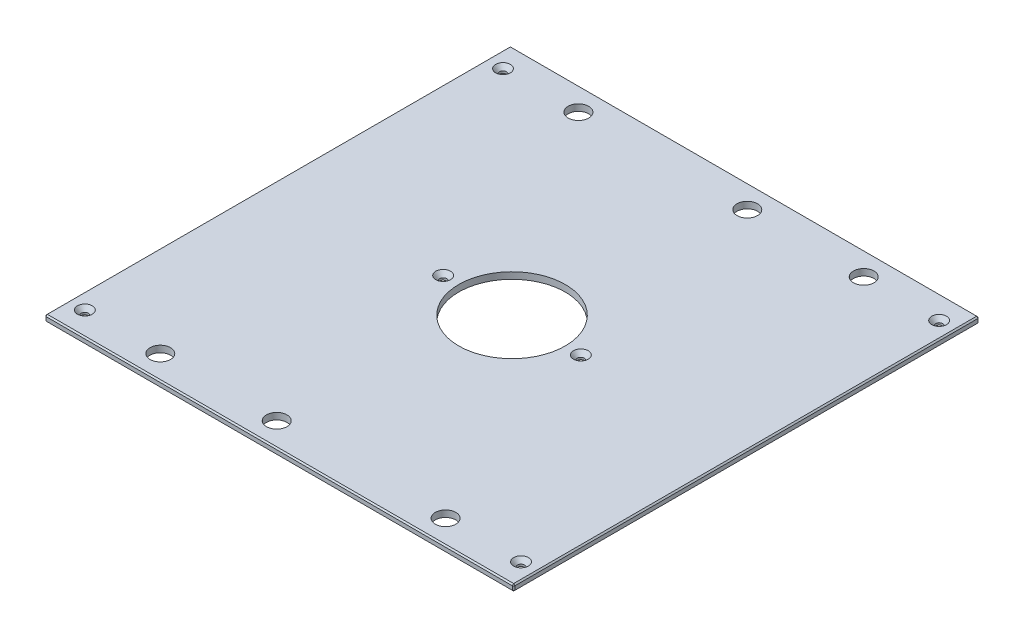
ISO-10303-21;
HEADER;
FILE_DESCRIPTION(('STEP AP214'),'2;1');
FILE_NAME('part.step','',(''),(''),'','','');
FILE_SCHEMA(('AUTOMOTIVE_DESIGN { 1 0 10303 214 1 1 1 1 }'));
ENDSEC;
DATA;
#1=APPLICATION_CONTEXT('core data for automotive mechanical design processes');
#2=APPLICATION_PROTOCOL_DEFINITION('international standard','automotive_design',2000,#1);
#3=PRODUCT_CONTEXT('',#1,'mechanical');
#4=PRODUCT('Part','Part','',(#3));
#5=PRODUCT_RELATED_PRODUCT_CATEGORY('part','',(#4));
#6=PRODUCT_DEFINITION_FORMATION('','',#4);
#7=PRODUCT_DEFINITION_CONTEXT('part definition',#1,'design');
#8=PRODUCT_DEFINITION('design','',#6,#7);
#9=PRODUCT_DEFINITION_SHAPE('','',#8);
#10=(LENGTH_UNIT() NAMED_UNIT(*) SI_UNIT(.MILLI.,.METRE.));
#11=(NAMED_UNIT(*) PLANE_ANGLE_UNIT() SI_UNIT($,.RADIAN.));
#12=(NAMED_UNIT(*) SI_UNIT($,.STERADIAN.) SOLID_ANGLE_UNIT());
#13=UNCERTAINTY_MEASURE_WITH_UNIT(LENGTH_MEASURE(1.E-05),#10,'distance_accuracy_value','');
#14=(GEOMETRIC_REPRESENTATION_CONTEXT(3) GLOBAL_UNCERTAINTY_ASSIGNED_CONTEXT((#13)) GLOBAL_UNIT_ASSIGNED_CONTEXT((#10,
#11,#12)) REPRESENTATION_CONTEXT('',''));
#15=CARTESIAN_POINT('',(0.,0.,0.));
#16=DIRECTION('',(0.,0.,1.));
#17=DIRECTION('',(1.,0.,0.));
#18=AXIS2_PLACEMENT_3D('',#15,#16,#17);
#19=CARTESIAN_POINT('',(-227.0125,6.35,-225.425));
#20=DIRECTION('',(1.,0.,0.));
#21=DIRECTION('',(0.,0.,-1.));
#22=AXIS2_PLACEMENT_3D('',#19,#20,#21);
#23=PLANE('',#22);
#24=DIRECTION('',(0.,0.,-1.));
#25=VECTOR('',#24,1.);
#26=CARTESIAN_POINT('',(-227.0125,5.08000000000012,-225.425));
#27=LINE('',#26,#25);
#28=CARTESIAN_POINT('',(-227.0125,5.08000000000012,224.155));
#29=VERTEX_POINT('',#28);
#30=CARTESIAN_POINT('',(-227.0125,5.08000000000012,-224.155));
#31=VERTEX_POINT('',#30);
#32=EDGE_CURVE('E135',#29,#31,#27,.T.);
#33=ORIENTED_EDGE('',*,*,#32,.T.);
#34=DIRECTION('',(0.,-1.,0.));
#35=VECTOR('',#34,1.);
#36=CARTESIAN_POINT('',(-227.0125,6.35,-224.155));
#37=LINE('',#36,#35);
#38=CARTESIAN_POINT('',(-227.0125,1.26999999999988,-224.155));
#39=VERTEX_POINT('',#38);
#40=EDGE_CURVE('E131',#31,#39,#37,.T.);
#41=ORIENTED_EDGE('',*,*,#40,.T.);
#42=DIRECTION('',(0.,0.,1.));
#43=VECTOR('',#42,1.);
#44=CARTESIAN_POINT('',(-227.0125,1.26999999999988,-225.425));
#45=LINE('',#44,#43);
#46=CARTESIAN_POINT('',(-227.0125,1.26999999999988,224.155));
#47=VERTEX_POINT('',#46);
#48=EDGE_CURVE('E126',#39,#47,#45,.T.);
#49=ORIENTED_EDGE('',*,*,#48,.T.);
#50=DIRECTION('',(0.,1.,0.));
#51=VECTOR('',#50,1.);
#52=CARTESIAN_POINT('',(-227.0125,6.35,224.155));
#53=LINE('',#52,#51);
#54=EDGE_CURVE('E128',#47,#29,#53,.T.);
#55=ORIENTED_EDGE('',*,*,#54,.T.);
#56=EDGE_LOOP('',(#33,#41,#49,#55));
#57=FACE_BOUND('',#56,.T.);
#58=ADVANCED_FACE('F35',(#57),#23,.F.);
#59=CARTESIAN_POINT('',(-227.0125,6.35,225.425));
#60=DIRECTION('',(0.,0.,-1.));
#61=DIRECTION('',(-1.,0.,0.));
#62=AXIS2_PLACEMENT_3D('',#59,#60,#61);
#63=PLANE('',#62);
#64=DIRECTION('',(1.,0.,0.));
#65=VECTOR('',#64,1.);
#66=CARTESIAN_POINT('',(-227.0125,1.26999999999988,225.425));
#67=LINE('',#66,#65);
#68=CARTESIAN_POINT('',(-225.7425,1.26999999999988,225.425));
#69=VERTEX_POINT('',#68);
#70=CARTESIAN_POINT('',(225.7425,1.26999999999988,225.425));
#71=VERTEX_POINT('',#70);
#72=EDGE_CURVE('E58',#69,#71,#67,.T.);
#73=ORIENTED_EDGE('',*,*,#72,.T.);
#74=DIRECTION('',(0.,1.,0.));
#75=VECTOR('',#74,1.);
#76=CARTESIAN_POINT('',(225.7425,6.35,225.425));
#77=LINE('',#76,#75);
#78=CARTESIAN_POINT('',(225.7425,5.08000000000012,225.425));
#79=VERTEX_POINT('',#78);
#80=EDGE_CURVE('E11',#71,#79,#77,.T.);
#81=ORIENTED_EDGE('',*,*,#80,.T.);
#82=DIRECTION('',(-1.,0.,0.));
#83=VECTOR('',#82,1.);
#84=CARTESIAN_POINT('',(-227.0125,5.08000000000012,225.425));
#85=LINE('',#84,#83);
#86=CARTESIAN_POINT('',(-225.7425,5.08000000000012,225.425));
#87=VERTEX_POINT('',#86);
#88=EDGE_CURVE('E44',#79,#87,#85,.T.);
#89=ORIENTED_EDGE('',*,*,#88,.T.);
#90=DIRECTION('',(0.,-1.,0.));
#91=VECTOR('',#90,1.);
#92=CARTESIAN_POINT('',(-225.7425,6.35,225.425));
#93=LINE('',#92,#91);
#94=EDGE_CURVE('E291',#87,#69,#93,.T.);
#95=ORIENTED_EDGE('',*,*,#94,.T.);
#96=EDGE_LOOP('',(#73,#81,#89,#95));
#97=FACE_BOUND('',#96,.T.);
#98=ADVANCED_FACE('F360',(#97),#63,.F.);
#99=CARTESIAN_POINT('',(227.0125,6.35,-225.425));
#100=DIRECTION('',(-1.,0.,0.));
#101=DIRECTION('',(0.,0.,1.));
#102=AXIS2_PLACEMENT_3D('',#99,#100,#101);
#103=PLANE('',#102);
#104=DIRECTION('',(0.,0.,-1.));
#105=VECTOR('',#104,1.);
#106=CARTESIAN_POINT('',(227.0125,1.26999999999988,-225.425));
#107=LINE('',#106,#105);
#108=CARTESIAN_POINT('',(227.0125,1.26999999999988,224.155));
#109=VERTEX_POINT('',#108);
#110=CARTESIAN_POINT('',(227.0125,1.26999999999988,-224.155));
#111=VERTEX_POINT('',#110);
#112=EDGE_CURVE('E286',#109,#111,#107,.T.);
#113=ORIENTED_EDGE('',*,*,#112,.T.);
#114=DIRECTION('',(0.,1.,0.));
#115=VECTOR('',#114,1.);
#116=CARTESIAN_POINT('',(227.0125,6.35,-224.155));
#117=LINE('',#116,#115);
#118=CARTESIAN_POINT('',(227.0125,5.08000000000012,-224.155));
#119=VERTEX_POINT('',#118);
#120=EDGE_CURVE('E288',#111,#119,#117,.T.);
#121=ORIENTED_EDGE('',*,*,#120,.T.);
#122=DIRECTION('',(0.,0.,1.));
#123=VECTOR('',#122,1.);
#124=CARTESIAN_POINT('',(227.0125,5.08000000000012,225.425));
#125=LINE('',#124,#123);
#126=CARTESIAN_POINT('',(227.0125,5.08000000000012,224.155));
#127=VERTEX_POINT('',#126);
#128=EDGE_CURVE('E284',#119,#127,#125,.T.);
#129=ORIENTED_EDGE('',*,*,#128,.T.);
#130=DIRECTION('',(0.,-1.,0.));
#131=VECTOR('',#130,1.);
#132=CARTESIAN_POINT('',(227.0125,6.35,224.155));
#133=LINE('',#132,#131);
#134=EDGE_CURVE('E282',#127,#109,#133,.T.);
#135=ORIENTED_EDGE('',*,*,#134,.T.);
#136=EDGE_LOOP('',(#113,#121,#129,#135));
#137=FACE_BOUND('',#136,.T.);
#138=ADVANCED_FACE('F347',(#137),#103,.F.);
#139=CARTESIAN_POINT('',(-227.0125,6.35,-225.425));
#140=DIRECTION('',(0.,0.,1.));
#141=DIRECTION('',(1.,0.,0.));
#142=AXIS2_PLACEMENT_3D('',#139,#140,#141);
#143=PLANE('',#142);
#144=DIRECTION('',(-1.,0.,0.));
#145=VECTOR('',#144,1.);
#146=CARTESIAN_POINT('',(-227.0125,1.26999999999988,-225.425));
#147=LINE('',#146,#145);
#148=CARTESIAN_POINT('',(225.7425,1.26999999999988,-225.425));
#149=VERTEX_POINT('',#148);
#150=CARTESIAN_POINT('',(-225.7425,1.26999999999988,-225.425));
#151=VERTEX_POINT('',#150);
#152=EDGE_CURVE('E258',#149,#151,#147,.T.);
#153=ORIENTED_EDGE('',*,*,#152,.T.);
#154=DIRECTION('',(0.,1.,0.));
#155=VECTOR('',#154,1.);
#156=CARTESIAN_POINT('',(-225.7425,6.35,-225.425));
#157=LINE('',#156,#155);
#158=CARTESIAN_POINT('',(-225.7425,5.08000000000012,-225.425));
#159=VERTEX_POINT('',#158);
#160=EDGE_CURVE('E262',#151,#159,#157,.T.);
#161=ORIENTED_EDGE('',*,*,#160,.T.);
#162=DIRECTION('',(1.,0.,0.));
#163=VECTOR('',#162,1.);
#164=CARTESIAN_POINT('',(227.0125,5.08000000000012,-225.425));
#165=LINE('',#164,#163);
#166=CARTESIAN_POINT('',(225.7425,5.08000000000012,-225.425));
#167=VERTEX_POINT('',#166);
#168=EDGE_CURVE('E260',#159,#167,#165,.T.);
#169=ORIENTED_EDGE('',*,*,#168,.T.);
#170=DIRECTION('',(0.,-1.,0.));
#171=VECTOR('',#170,1.);
#172=CARTESIAN_POINT('',(225.7425,6.35,-225.425));
#173=LINE('',#172,#171);
#174=EDGE_CURVE('E256',#167,#149,#173,.T.);
#175=ORIENTED_EDGE('',*,*,#174,.T.);
#176=EDGE_LOOP('',(#153,#161,#169,#175));
#177=FACE_BOUND('',#176,.T.);
#178=ADVANCED_FACE('F321',(#177),#143,.F.);
#179=CARTESIAN_POINT('',(0.,6.35,0.));
#180=DIRECTION('',(0.,1.,0.));
#181=DIRECTION('',(0.,0.,1.));
#182=AXIS2_PLACEMENT_3D('',#179,#180,#181);
#183=PLANE('',#182);
#184=CARTESIAN_POINT('',(211.1375,6.35,-202.40498));
#185=DIRECTION('',(0.,1.,0.));
#186=DIRECTION('',(0.,0.,1.));
#187=AXIS2_PLACEMENT_3D('',#184,#185,#186);
#188=CIRCLE('',#187,7.13739999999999);
#189=CARTESIAN_POINT('',(211.1375,6.35,-195.26758));
#190=VERTEX_POINT('',#189);
#191=EDGE_CURVE('E784',#190,#190,#188,.T.);
#192=ORIENTED_EDGE('',*,*,#191,.F.);
#193=EDGE_LOOP('',(#192));
#194=FACE_BOUND('',#193,.T.);
#195=CARTESIAN_POINT('',(211.1375,6.35,202.40498));
#196=DIRECTION('',(0.,1.,0.));
#197=DIRECTION('',(0.,0.,1.));
#198=AXIS2_PLACEMENT_3D('',#195,#196,#197);
#199=CIRCLE('',#198,7.13739999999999);
#200=CARTESIAN_POINT('',(211.1375,6.35,209.54238));
#201=VERTEX_POINT('',#200);
#202=EDGE_CURVE('E788',#201,#201,#199,.T.);
#203=ORIENTED_EDGE('',*,*,#202,.F.);
#204=EDGE_LOOP('',(#203));
#205=FACE_BOUND('',#204,.T.);
#206=CARTESIAN_POINT('',(-211.1375,6.35,202.40498));
#207=DIRECTION('',(0.,1.,0.));
#208=DIRECTION('',(0.,0.,1.));
#209=AXIS2_PLACEMENT_3D('',#206,#207,#208);
#210=CIRCLE('',#209,7.13739999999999);
#211=CARTESIAN_POINT('',(-211.1375,6.35,209.54238));
#212=VERTEX_POINT('',#211);
#213=EDGE_CURVE('E792',#212,#212,#210,.T.);
#214=ORIENTED_EDGE('',*,*,#213,.F.);
#215=EDGE_LOOP('',(#214));
#216=FACE_BOUND('',#215,.T.);
#217=CARTESIAN_POINT('',(-66.675,6.35,0.));
#218=DIRECTION('',(0.,1.,0.));
#219=DIRECTION('',(0.,0.,1.));
#220=AXIS2_PLACEMENT_3D('',#217,#218,#219);
#221=CIRCLE('',#220,7.1374);
#222=CARTESIAN_POINT('',(-66.675,6.35,7.1374));
#223=VERTEX_POINT('',#222);
#224=EDGE_CURVE('E796',#223,#223,#221,.T.);
#225=ORIENTED_EDGE('',*,*,#224,.F.);
#226=EDGE_LOOP('',(#225));
#227=FACE_BOUND('',#226,.T.);
#228=CARTESIAN_POINT('',(66.675,6.35,0.));
#229=DIRECTION('',(0.,1.,0.));
#230=DIRECTION('',(0.,0.,1.));
#231=AXIS2_PLACEMENT_3D('',#228,#229,#230);
#232=CIRCLE('',#231,7.1374);
#233=CARTESIAN_POINT('',(66.675,6.35,7.1374));
#234=VERTEX_POINT('',#233);
#235=EDGE_CURVE('E800',#234,#234,#232,.T.);
#236=ORIENTED_EDGE('',*,*,#235,.F.);
#237=EDGE_LOOP('',(#236));
#238=FACE_BOUND('',#237,.T.);
#239=CARTESIAN_POINT('',(-211.1375,6.35,-202.40498));
#240=DIRECTION('',(0.,1.,0.));
#241=DIRECTION('',(0.,0.,1.));
#242=AXIS2_PLACEMENT_3D('',#239,#240,#241);
#243=CIRCLE('',#242,7.13739999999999);
#244=CARTESIAN_POINT('',(-211.1375,6.35,-195.26758));
#245=VERTEX_POINT('',#244);
#246=EDGE_CURVE('E803',#245,#245,#243,.T.);
#247=ORIENTED_EDGE('',*,*,#246,.F.);
#248=EDGE_LOOP('',(#247));
#249=FACE_BOUND('',#248,.T.);
#250=DIRECTION('',(0.,0.,-1.));
#251=VECTOR('',#250,1.);
#252=CARTESIAN_POINT('',(225.7425,6.35,-225.425));
#253=LINE('',#252,#251);
#254=CARTESIAN_POINT('',(225.7425,6.35,224.155));
#255=VERTEX_POINT('',#254);
#256=CARTESIAN_POINT('',(225.7425,6.35,-224.155));
#257=VERTEX_POINT('',#256);
#258=EDGE_CURVE('E269',#255,#257,#253,.T.);
#259=ORIENTED_EDGE('',*,*,#258,.T.);
#260=DIRECTION('',(-1.,0.,0.));
#261=VECTOR('',#260,1.);
#262=CARTESIAN_POINT('',(-227.0125,6.35,-224.155));
#263=LINE('',#262,#261);
#264=CARTESIAN_POINT('',(-225.7425,6.35,-224.155));
#265=VERTEX_POINT('',#264);
#266=EDGE_CURVE('E271',#257,#265,#263,.T.);
#267=ORIENTED_EDGE('',*,*,#266,.T.);
#268=DIRECTION('',(0.,0.,1.));
#269=VECTOR('',#268,1.);
#270=CARTESIAN_POINT('',(-225.7425,6.35,225.425));
#271=LINE('',#270,#269);
#272=CARTESIAN_POINT('',(-225.7425,6.35,224.155));
#273=VERTEX_POINT('',#272);
#274=EDGE_CURVE('E267',#265,#273,#271,.T.);
#275=ORIENTED_EDGE('',*,*,#274,.T.);
#276=DIRECTION('',(1.,0.,0.));
#277=VECTOR('',#276,1.);
#278=CARTESIAN_POINT('',(227.0125,6.35,224.155));
#279=LINE('',#278,#277);
#280=EDGE_CURVE('E265',#273,#255,#279,.T.);
#281=ORIENTED_EDGE('',*,*,#280,.T.);
#282=EDGE_LOOP('',(#259,#267,#275,#281));
#283=FACE_BOUND('',#282,.T.);
#284=CARTESIAN_POINT('',(138.1125,6.35,-202.40498));
#285=DIRECTION('',(0.,1.,0.));
#286=DIRECTION('',(0.,0.,1.));
#287=AXIS2_PLACEMENT_3D('',#284,#285,#286);
#288=CIRCLE('',#287,9.921875);
#289=CARTESIAN_POINT('',(138.1125,6.35,-192.483105));
#290=VERTEX_POINT('',#289);
#291=EDGE_CURVE('E204',#290,#290,#288,.T.);
#292=ORIENTED_EDGE('',*,*,#291,.F.);
#293=EDGE_LOOP('',(#292));
#294=FACE_BOUND('',#293,.T.);
#295=CARTESIAN_POINT('',(-138.1125,6.35,-202.40498));
#296=DIRECTION('',(0.,1.,0.));
#297=DIRECTION('',(0.,0.,1.));
#298=AXIS2_PLACEMENT_3D('',#295,#296,#297);
#299=CIRCLE('',#298,9.921875);
#300=CARTESIAN_POINT('',(-138.1125,6.35,-192.483105));
#301=VERTEX_POINT('',#300);
#302=EDGE_CURVE('E214',#301,#301,#299,.T.);
#303=ORIENTED_EDGE('',*,*,#302,.F.);
#304=EDGE_LOOP('',(#303));
#305=FACE_BOUND('',#304,.T.);
#306=CARTESIAN_POINT('',(138.1125,6.35,202.40498));
#307=DIRECTION('',(0.,1.,0.));
#308=DIRECTION('',(0.,0.,1.));
#309=AXIS2_PLACEMENT_3D('',#306,#307,#308);
#310=CIRCLE('',#309,9.921875);
#311=CARTESIAN_POINT('',(138.1125,6.35,212.326855));
#312=VERTEX_POINT('',#311);
#313=EDGE_CURVE('E225',#312,#312,#310,.T.);
#314=ORIENTED_EDGE('',*,*,#313,.F.);
#315=EDGE_LOOP('',(#314));
#316=FACE_BOUND('',#315,.T.);
#317=CARTESIAN_POINT('',(-138.1125,6.35,202.40498));
#318=DIRECTION('',(0.,1.,0.));
#319=DIRECTION('',(0.,0.,1.));
#320=AXIS2_PLACEMENT_3D('',#317,#318,#319);
#321=CIRCLE('',#320,9.921875);
#322=CARTESIAN_POINT('',(-138.1125,6.35,212.326855));
#323=VERTEX_POINT('',#322);
#324=EDGE_CURVE('E231',#323,#323,#321,.T.);
#325=ORIENTED_EDGE('',*,*,#324,.F.);
#326=EDGE_LOOP('',(#325));
#327=FACE_BOUND('',#326,.T.);
#328=CARTESIAN_POINT('',(25.4,6.35,-202.40498));
#329=DIRECTION('',(0.,1.,0.));
#330=DIRECTION('',(0.,0.,1.));
#331=AXIS2_PLACEMENT_3D('',#328,#329,#330);
#332=CIRCLE('',#331,9.921875);
#333=CARTESIAN_POINT('',(25.4,6.35,-192.483105));
#334=VERTEX_POINT('',#333);
#335=EDGE_CURVE('E237',#334,#334,#332,.T.);
#336=ORIENTED_EDGE('',*,*,#335,.F.);
#337=EDGE_LOOP('',(#336));
#338=FACE_BOUND('',#337,.T.);
#339=CARTESIAN_POINT('',(-25.4,6.35,202.40498));
#340=DIRECTION('',(0.,1.,0.));
#341=DIRECTION('',(0.,0.,1.));
#342=AXIS2_PLACEMENT_3D('',#339,#340,#341);
#343=CIRCLE('',#342,9.921875);
#344=CARTESIAN_POINT('',(-25.4,6.35,212.326855));
#345=VERTEX_POINT('',#344);
#346=EDGE_CURVE('E243',#345,#345,#343,.T.);
#347=ORIENTED_EDGE('',*,*,#346,.F.);
#348=EDGE_LOOP('',(#347));
#349=FACE_BOUND('',#348,.T.);
#350=CARTESIAN_POINT('',(0.,6.35,0.));
#351=DIRECTION('',(0.,1.,0.));
#352=DIRECTION('',(0.,0.,1.));
#353=AXIS2_PLACEMENT_3D('',#350,#351,#352);
#354=CIRCLE('',#353,51.562);
#355=CARTESIAN_POINT('',(0.,6.35,51.562));
#356=VERTEX_POINT('',#355);
#357=EDGE_CURVE('E249',#356,#356,#354,.T.);
#358=ORIENTED_EDGE('',*,*,#357,.F.);
#359=EDGE_LOOP('',(#358));
#360=FACE_BOUND('',#359,.T.);
#361=ADVANCED_FACE('F369',(#194,#205,#216,#227,#238,#249,#283,#294,#305,#316,#327,#338,#349,
#360),#183,.T.);
#362=CARTESIAN_POINT('',(0.,0.,0.));
#363=DIRECTION('',(0.,1.,0.));
#364=DIRECTION('',(0.,0.,1.));
#365=AXIS2_PLACEMENT_3D('',#362,#363,#364);
#366=PLANE('',#365);
#367=CARTESIAN_POINT('',(211.1375,0.,-202.40498));
#368=DIRECTION('',(0.,1.,0.));
#369=DIRECTION('',(0.,0.,1.));
#370=AXIS2_PLACEMENT_3D('',#367,#368,#369);
#371=CIRCLE('',#370,3.3782);
#372=CARTESIAN_POINT('',(211.1375,0.,-199.02678));
#373=VERTEX_POINT('',#372);
#374=EDGE_CURVE('E837',#373,#373,#371,.T.);
#375=ORIENTED_EDGE('',*,*,#374,.T.);
#376=EDGE_LOOP('',(#375));
#377=FACE_BOUND('',#376,.T.);
#378=CARTESIAN_POINT('',(211.1375,0.,202.40498));
#379=DIRECTION('',(0.,1.,0.));
#380=DIRECTION('',(0.,0.,1.));
#381=AXIS2_PLACEMENT_3D('',#378,#379,#380);
#382=CIRCLE('',#381,3.3782);
#383=CARTESIAN_POINT('',(211.1375,0.,205.78318));
#384=VERTEX_POINT('',#383);
#385=EDGE_CURVE('E830',#384,#384,#382,.T.);
#386=ORIENTED_EDGE('',*,*,#385,.T.);
#387=EDGE_LOOP('',(#386));
#388=FACE_BOUND('',#387,.T.);
#389=CARTESIAN_POINT('',(-211.1375,0.,202.40498));
#390=DIRECTION('',(0.,1.,0.));
#391=DIRECTION('',(0.,0.,1.));
#392=AXIS2_PLACEMENT_3D('',#389,#390,#391);
#393=CIRCLE('',#392,3.3782);
#394=CARTESIAN_POINT('',(-211.1375,0.,205.78318));
#395=VERTEX_POINT('',#394);
#396=EDGE_CURVE('E823',#395,#395,#393,.T.);
#397=ORIENTED_EDGE('',*,*,#396,.T.);
#398=EDGE_LOOP('',(#397));
#399=FACE_BOUND('',#398,.T.);
#400=CARTESIAN_POINT('',(-66.675,0.,0.));
#401=DIRECTION('',(0.,1.,0.));
#402=DIRECTION('',(0.,0.,1.));
#403=AXIS2_PLACEMENT_3D('',#400,#401,#402);
#404=CIRCLE('',#403,3.3782);
#405=CARTESIAN_POINT('',(-66.675,0.,3.3782));
#406=VERTEX_POINT('',#405);
#407=EDGE_CURVE('E816',#406,#406,#404,.T.);
#408=ORIENTED_EDGE('',*,*,#407,.T.);
#409=EDGE_LOOP('',(#408));
#410=FACE_BOUND('',#409,.T.);
#411=CARTESIAN_POINT('',(66.675,0.,0.));
#412=DIRECTION('',(0.,1.,0.));
#413=DIRECTION('',(0.,0.,1.));
#414=AXIS2_PLACEMENT_3D('',#411,#412,#413);
#415=CIRCLE('',#414,3.3782);
#416=CARTESIAN_POINT('',(66.675,0.,3.3782));
#417=VERTEX_POINT('',#416);
#418=EDGE_CURVE('E806',#417,#417,#415,.T.);
#419=ORIENTED_EDGE('',*,*,#418,.T.);
#420=EDGE_LOOP('',(#419));
#421=FACE_BOUND('',#420,.T.);
#422=CARTESIAN_POINT('',(-211.1375,0.,-202.40498));
#423=DIRECTION('',(0.,1.,0.));
#424=DIRECTION('',(0.,0.,1.));
#425=AXIS2_PLACEMENT_3D('',#422,#423,#424);
#426=CIRCLE('',#425,3.3782);
#427=CARTESIAN_POINT('',(-211.1375,0.,-199.02678));
#428=VERTEX_POINT('',#427);
#429=EDGE_CURVE('E217',#428,#428,#426,.T.);
#430=ORIENTED_EDGE('',*,*,#429,.T.);
#431=EDGE_LOOP('',(#430));
#432=FACE_BOUND('',#431,.T.);
#433=DIRECTION('',(0.,0.,-1.));
#434=VECTOR('',#433,1.);
#435=CARTESIAN_POINT('',(-225.7425,0.,0.));
#436=LINE('',#435,#434);
#437=CARTESIAN_POINT('',(-225.7425,0.,224.155));
#438=VERTEX_POINT('',#437);
#439=CARTESIAN_POINT('',(-225.7425,0.,-224.155));
#440=VERTEX_POINT('',#439);
#441=EDGE_CURVE('E158',#438,#440,#436,.T.);
#442=ORIENTED_EDGE('',*,*,#441,.T.);
#443=DIRECTION('',(1.,0.,0.));
#444=VECTOR('',#443,1.);
#445=CARTESIAN_POINT('',(0.,0.,-224.155));
#446=LINE('',#445,#444);
#447=CARTESIAN_POINT('',(225.7425,0.,-224.155));
#448=VERTEX_POINT('',#447);
#449=EDGE_CURVE('E279',#440,#448,#446,.T.);
#450=ORIENTED_EDGE('',*,*,#449,.T.);
#451=DIRECTION('',(0.,0.,1.));
#452=VECTOR('',#451,1.);
#453=CARTESIAN_POINT('',(225.7425,0.,0.));
#454=LINE('',#453,#452);
#455=CARTESIAN_POINT('',(225.7425,0.,224.155));
#456=VERTEX_POINT('',#455);
#457=EDGE_CURVE('E277',#448,#456,#454,.T.);
#458=ORIENTED_EDGE('',*,*,#457,.T.);
#459=DIRECTION('',(-1.,0.,0.));
#460=VECTOR('',#459,1.);
#461=CARTESIAN_POINT('',(0.,0.,224.155));
#462=LINE('',#461,#460);
#463=EDGE_CURVE('E274',#456,#438,#462,.T.);
#464=ORIENTED_EDGE('',*,*,#463,.T.);
#465=EDGE_LOOP('',(#442,#450,#458,#464));
#466=FACE_BOUND('',#465,.T.);
#467=CARTESIAN_POINT('',(138.1125,0.,-202.40498));
#468=DIRECTION('',(0.,1.,0.));
#469=DIRECTION('',(0.,0.,1.));
#470=AXIS2_PLACEMENT_3D('',#467,#468,#469);
#471=CIRCLE('',#470,9.921875);
#472=CARTESIAN_POINT('',(138.1125,0.,-192.483105));
#473=VERTEX_POINT('',#472);
#474=EDGE_CURVE('E209',#473,#473,#471,.T.);
#475=ORIENTED_EDGE('',*,*,#474,.T.);
#476=EDGE_LOOP('',(#475));
#477=FACE_BOUND('',#476,.T.);
#478=CARTESIAN_POINT('',(-138.1125,0.,-202.40498));
#479=DIRECTION('',(0.,1.,0.));
#480=DIRECTION('',(0.,0.,1.));
#481=AXIS2_PLACEMENT_3D('',#478,#479,#480);
#482=CIRCLE('',#481,9.921875);
#483=CARTESIAN_POINT('',(-138.1125,0.,-192.483105));
#484=VERTEX_POINT('',#483);
#485=EDGE_CURVE('E222',#484,#484,#482,.T.);
#486=ORIENTED_EDGE('',*,*,#485,.T.);
#487=EDGE_LOOP('',(#486));
#488=FACE_BOUND('',#487,.T.);
#489=CARTESIAN_POINT('',(138.1125,0.,202.40498));
#490=DIRECTION('',(0.,1.,0.));
#491=DIRECTION('',(0.,0.,1.));
#492=AXIS2_PLACEMENT_3D('',#489,#490,#491);
#493=CIRCLE('',#492,9.921875);
#494=CARTESIAN_POINT('',(138.1125,0.,212.326855));
#495=VERTEX_POINT('',#494);
#496=EDGE_CURVE('E228',#495,#495,#493,.T.);
#497=ORIENTED_EDGE('',*,*,#496,.T.);
#498=EDGE_LOOP('',(#497));
#499=FACE_BOUND('',#498,.T.);
#500=CARTESIAN_POINT('',(-138.1125,0.,202.40498));
#501=DIRECTION('',(0.,1.,0.));
#502=DIRECTION('',(0.,0.,1.));
#503=AXIS2_PLACEMENT_3D('',#500,#501,#502);
#504=CIRCLE('',#503,9.921875);
#505=CARTESIAN_POINT('',(-138.1125,0.,212.326855));
#506=VERTEX_POINT('',#505);
#507=EDGE_CURVE('E234',#506,#506,#504,.T.);
#508=ORIENTED_EDGE('',*,*,#507,.T.);
#509=EDGE_LOOP('',(#508));
#510=FACE_BOUND('',#509,.T.);
#511=CARTESIAN_POINT('',(25.4,0.,-202.40498));
#512=DIRECTION('',(0.,1.,0.));
#513=DIRECTION('',(0.,0.,1.));
#514=AXIS2_PLACEMENT_3D('',#511,#512,#513);
#515=CIRCLE('',#514,9.921875);
#516=CARTESIAN_POINT('',(25.4,0.,-192.483105));
#517=VERTEX_POINT('',#516);
#518=EDGE_CURVE('E240',#517,#517,#515,.T.);
#519=ORIENTED_EDGE('',*,*,#518,.T.);
#520=EDGE_LOOP('',(#519));
#521=FACE_BOUND('',#520,.T.);
#522=CARTESIAN_POINT('',(-25.4,0.,202.40498));
#523=DIRECTION('',(0.,1.,0.));
#524=DIRECTION('',(0.,0.,1.));
#525=AXIS2_PLACEMENT_3D('',#522,#523,#524);
#526=CIRCLE('',#525,9.921875);
#527=CARTESIAN_POINT('',(-25.4,0.,212.326855));
#528=VERTEX_POINT('',#527);
#529=EDGE_CURVE('E246',#528,#528,#526,.T.);
#530=ORIENTED_EDGE('',*,*,#529,.T.);
#531=EDGE_LOOP('',(#530));
#532=FACE_BOUND('',#531,.T.);
#533=CARTESIAN_POINT('',(0.,0.,0.));
#534=DIRECTION('',(0.,1.,0.));
#535=DIRECTION('',(0.,0.,1.));
#536=AXIS2_PLACEMENT_3D('',#533,#534,#535);
#537=CIRCLE('',#536,51.562);
#538=CARTESIAN_POINT('',(0.,0.,51.562));
#539=VERTEX_POINT('',#538);
#540=EDGE_CURVE('E147',#539,#539,#537,.T.);
#541=ORIENTED_EDGE('',*,*,#540,.T.);
#542=EDGE_LOOP('',(#541));
#543=FACE_BOUND('',#542,.T.);
#544=ADVANCED_FACE('F334',(#377,#388,#399,#410,#421,#432,#466,#477,#488,#499,#510,#521,#532,
#543),#366,.F.);
#545=CARTESIAN_POINT('',(0.,0.,0.));
#546=DIRECTION('',(0.,1.,0.));
#547=DIRECTION('',(0.,0.,1.));
#548=AXIS2_PLACEMENT_3D('',#545,#546,#547);
#549=CYLINDRICAL_SURFACE('',#548,51.562);
#550=ORIENTED_EDGE('',*,*,#540,.F.);
#551=EDGE_LOOP('',(#550));
#552=FACE_BOUND('',#551,.T.);
#553=ORIENTED_EDGE('',*,*,#357,.T.);
#554=EDGE_LOOP('',(#553));
#555=FACE_BOUND('',#554,.T.);
#556=ADVANCED_FACE('F721',(#552,#555),#549,.F.);
#557=CARTESIAN_POINT('',(-25.4,6.35,202.40498));
#558=DIRECTION('',(0.,1.,0.));
#559=DIRECTION('',(0.,0.,1.));
#560=AXIS2_PLACEMENT_3D('',#557,#558,#559);
#561=CYLINDRICAL_SURFACE('',#560,9.921875);
#562=ORIENTED_EDGE('',*,*,#529,.F.);
#563=EDGE_LOOP('',(#562));
#564=FACE_BOUND('',#563,.T.);
#565=ORIENTED_EDGE('',*,*,#346,.T.);
#566=EDGE_LOOP('',(#565));
#567=FACE_BOUND('',#566,.T.);
#568=ADVANCED_FACE('F712',(#564,#567),#561,.F.);
#569=CARTESIAN_POINT('',(25.4,6.35,-202.40498));
#570=DIRECTION('',(0.,1.,0.));
#571=DIRECTION('',(0.,0.,1.));
#572=AXIS2_PLACEMENT_3D('',#569,#570,#571);
#573=CYLINDRICAL_SURFACE('',#572,9.921875);
#574=ORIENTED_EDGE('',*,*,#518,.F.);
#575=EDGE_LOOP('',(#574));
#576=FACE_BOUND('',#575,.T.);
#577=ORIENTED_EDGE('',*,*,#335,.T.);
#578=EDGE_LOOP('',(#577));
#579=FACE_BOUND('',#578,.T.);
#580=ADVANCED_FACE('F703',(#576,#579),#573,.F.);
#581=CARTESIAN_POINT('',(-138.1125,6.35,202.40498));
#582=DIRECTION('',(0.,1.,0.));
#583=DIRECTION('',(0.,0.,1.));
#584=AXIS2_PLACEMENT_3D('',#581,#582,#583);
#585=CYLINDRICAL_SURFACE('',#584,9.921875);
#586=ORIENTED_EDGE('',*,*,#507,.F.);
#587=EDGE_LOOP('',(#586));
#588=FACE_BOUND('',#587,.T.);
#589=ORIENTED_EDGE('',*,*,#324,.T.);
#590=EDGE_LOOP('',(#589));
#591=FACE_BOUND('',#590,.T.);
#592=ADVANCED_FACE('F694',(#588,#591),#585,.F.);
#593=CARTESIAN_POINT('',(138.1125,6.35,202.40498));
#594=DIRECTION('',(0.,1.,0.));
#595=DIRECTION('',(0.,0.,1.));
#596=AXIS2_PLACEMENT_3D('',#593,#594,#595);
#597=CYLINDRICAL_SURFACE('',#596,9.921875);
#598=ORIENTED_EDGE('',*,*,#496,.F.);
#599=EDGE_LOOP('',(#598));
#600=FACE_BOUND('',#599,.T.);
#601=ORIENTED_EDGE('',*,*,#313,.T.);
#602=EDGE_LOOP('',(#601));
#603=FACE_BOUND('',#602,.T.);
#604=ADVANCED_FACE('F685',(#600,#603),#597,.F.);
#605=CARTESIAN_POINT('',(-138.1125,6.35,-202.40498));
#606=DIRECTION('',(0.,1.,0.));
#607=DIRECTION('',(0.,0.,1.));
#608=AXIS2_PLACEMENT_3D('',#605,#606,#607);
#609=CYLINDRICAL_SURFACE('',#608,9.921875);
#610=ORIENTED_EDGE('',*,*,#485,.F.);
#611=EDGE_LOOP('',(#610));
#612=FACE_BOUND('',#611,.T.);
#613=ORIENTED_EDGE('',*,*,#302,.T.);
#614=EDGE_LOOP('',(#613));
#615=FACE_BOUND('',#614,.T.);
#616=ADVANCED_FACE('F675',(#612,#615),#609,.F.);
#617=CARTESIAN_POINT('',(138.1125,6.35,-202.40498));
#618=DIRECTION('',(0.,1.,0.));
#619=DIRECTION('',(0.,0.,1.));
#620=AXIS2_PLACEMENT_3D('',#617,#618,#619);
#621=CYLINDRICAL_SURFACE('',#620,9.921875);
#622=ORIENTED_EDGE('',*,*,#474,.F.);
#623=EDGE_LOOP('',(#622));
#624=FACE_BOUND('',#623,.T.);
#625=ORIENTED_EDGE('',*,*,#291,.T.);
#626=EDGE_LOOP('',(#625));
#627=FACE_BOUND('',#626,.T.);
#628=ADVANCED_FACE('F378',(#624,#627),#621,.F.);
#629=CARTESIAN_POINT('',(227.0125,6.35,224.155));
#630=DIRECTION('',(-0.707106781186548,0.,-0.707106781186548));
#631=DIRECTION('',(0.,-1.,0.));
#632=AXIS2_PLACEMENT_3D('',#629,#630,#631);
#633=PLANE('',#632);
#634=DIRECTION('',(-0.707106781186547,0.,0.707106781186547));
#635=VECTOR('',#634,1.);
#636=CARTESIAN_POINT('',(227.0125,5.08000000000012,224.155));
#637=LINE('',#636,#635);
#638=EDGE_CURVE('E39',#79,#127,#637,.F.);
#639=ORIENTED_EDGE('',*,*,#638,.F.);
#640=ORIENTED_EDGE('',*,*,#80,.F.);
#641=DIRECTION('',(0.707106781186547,0.,-0.707106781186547));
#642=VECTOR('',#641,1.);
#643=CARTESIAN_POINT('',(226.3775,1.26999999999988,224.79));
#644=LINE('',#643,#642);
#645=EDGE_CURVE('E197',#109,#71,#644,.F.);
#646=ORIENTED_EDGE('',*,*,#645,.F.);
#647=ORIENTED_EDGE('',*,*,#134,.F.);
#648=EDGE_LOOP('',(#639,#640,#646,#647));
#649=FACE_BOUND('',#648,.T.);
#650=ADVANCED_FACE('F37',(#649),#633,.F.);
#651=CARTESIAN_POINT('',(227.0125,5.08000000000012,224.155));
#652=DIRECTION('',(0.577350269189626,0.577350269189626,0.577350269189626));
#653=DIRECTION('',(0.707106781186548,0.,-0.707106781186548));
#654=AXIS2_PLACEMENT_3D('',#651,#652,#653);
#655=PLANE('',#654);
#656=DIRECTION('',(0.,-0.707106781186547,0.707106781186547));
#657=VECTOR('',#656,1.);
#658=CARTESIAN_POINT('',(225.7425,5.71500000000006,224.79));
#659=LINE('',#658,#657);
#660=EDGE_CURVE('E193',#79,#255,#659,.F.);
#661=ORIENTED_EDGE('',*,*,#660,.F.);
#662=ORIENTED_EDGE('',*,*,#638,.T.);
#663=DIRECTION('',(-0.707106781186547,0.707106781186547,0.));
#664=VECTOR('',#663,1.);
#665=CARTESIAN_POINT('',(227.0125,5.08000000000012,224.155));
#666=LINE('',#665,#664);
#667=EDGE_CURVE('E195',#255,#127,#666,.F.);
#668=ORIENTED_EDGE('',*,*,#667,.F.);
#669=EDGE_LOOP('',(#661,#662,#668));
#670=FACE_BOUND('',#669,.T.);
#671=ADVANCED_FACE('F371',(#670),#655,.T.);
#672=CARTESIAN_POINT('',(225.7425,0.,224.155));
#673=DIRECTION('',(0.577350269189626,-0.577350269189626,0.577350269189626));
#674=DIRECTION('',(0.707106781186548,0.,-0.707106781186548));
#675=AXIS2_PLACEMENT_3D('',#672,#673,#674);
#676=PLANE('',#675);
#677=DIRECTION('',(-0.707106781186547,-0.707106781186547,0.));
#678=VECTOR('',#677,1.);
#679=CARTESIAN_POINT('',(225.7425,0.,224.155));
#680=LINE('',#679,#678);
#681=EDGE_CURVE('E187',#109,#456,#680,.T.);
#682=ORIENTED_EDGE('',*,*,#681,.F.);
#683=ORIENTED_EDGE('',*,*,#645,.T.);
#684=DIRECTION('',(0.,0.707106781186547,0.707106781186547));
#685=VECTOR('',#684,1.);
#686=CARTESIAN_POINT('',(225.7425,0.,224.155));
#687=LINE('',#686,#685);
#688=EDGE_CURVE('E190',#456,#71,#687,.T.);
#689=ORIENTED_EDGE('',*,*,#688,.F.);
#690=EDGE_LOOP('',(#682,#683,#689));
#691=FACE_BOUND('',#690,.T.);
#692=ADVANCED_FACE('F340',(#691),#676,.T.);
#693=CARTESIAN_POINT('',(225.7425,6.35,0.));
#694=DIRECTION('',(0.707106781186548,0.707106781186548,0.));
#695=DIRECTION('',(0.,0.,1.));
#696=AXIS2_PLACEMENT_3D('',#693,#694,#695);
#697=PLANE('',#696);
#698=ORIENTED_EDGE('',*,*,#667,.T.);
#699=ORIENTED_EDGE('',*,*,#128,.F.);
#700=DIRECTION('',(0.707106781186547,-0.707106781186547,0.));
#701=VECTOR('',#700,1.);
#702=CARTESIAN_POINT('',(226.3775,5.71500000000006,-224.155));
#703=LINE('',#702,#701);
#704=EDGE_CURVE('E182',#257,#119,#703,.T.);
#705=ORIENTED_EDGE('',*,*,#704,.F.);
#706=ORIENTED_EDGE('',*,*,#258,.F.);
#707=EDGE_LOOP('',(#698,#699,#705,#706));
#708=FACE_BOUND('',#707,.T.);
#709=ADVANCED_FACE('F357',(#708),#697,.T.);
#710=CARTESIAN_POINT('',(0.,6.35,224.155));
#711=DIRECTION('',(0.,0.707106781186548,0.707106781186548));
#712=DIRECTION('',(-1.,0.,0.));
#713=AXIS2_PLACEMENT_3D('',#710,#711,#712);
#714=PLANE('',#713);
#715=ORIENTED_EDGE('',*,*,#660,.T.);
#716=ORIENTED_EDGE('',*,*,#280,.F.);
#717=DIRECTION('',(0.,0.707106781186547,-0.707106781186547));
#718=VECTOR('',#717,1.);
#719=CARTESIAN_POINT('',(-225.7425,6.35,224.155));
#720=LINE('',#719,#718);
#721=EDGE_CURVE('E179',#87,#273,#720,.T.);
#722=ORIENTED_EDGE('',*,*,#721,.F.);
#723=ORIENTED_EDGE('',*,*,#88,.F.);
#724=EDGE_LOOP('',(#715,#716,#722,#723));
#725=FACE_BOUND('',#724,.T.);
#726=ADVANCED_FACE('F362',(#725),#714,.T.);
#727=CARTESIAN_POINT('',(-225.7425,6.35,225.425));
#728=DIRECTION('',(0.707106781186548,0.,-0.707106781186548));
#729=DIRECTION('',(0.,-1.,0.));
#730=AXIS2_PLACEMENT_3D('',#727,#728,#729);
#731=PLANE('',#730);
#732=DIRECTION('',(0.707106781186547,0.,0.707106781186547));
#733=VECTOR('',#732,1.);
#734=CARTESIAN_POINT('',(-227.0125,1.26999999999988,224.155));
#735=LINE('',#734,#733);
#736=EDGE_CURVE('E142',#69,#47,#735,.F.);
#737=ORIENTED_EDGE('',*,*,#736,.F.);
#738=ORIENTED_EDGE('',*,*,#94,.F.);
#739=DIRECTION('',(-0.707106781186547,0.,-0.707106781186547));
#740=VECTOR('',#739,1.);
#741=CARTESIAN_POINT('',(-226.3775,5.08000000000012,224.79));
#742=LINE('',#741,#740);
#743=EDGE_CURVE('E145',#29,#87,#742,.F.);
#744=ORIENTED_EDGE('',*,*,#743,.F.);
#745=ORIENTED_EDGE('',*,*,#54,.F.);
#746=EDGE_LOOP('',(#737,#738,#744,#745));
#747=FACE_BOUND('',#746,.T.);
#748=ADVANCED_FACE('F140',(#747),#731,.F.);
#749=CARTESIAN_POINT('',(-227.0125,1.26999999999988,225.425));
#750=DIRECTION('',(0.,0.707106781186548,-0.707106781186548));
#751=DIRECTION('',(1.,0.,0.));
#752=AXIS2_PLACEMENT_3D('',#749,#750,#751);
#753=PLANE('',#752);
#754=ORIENTED_EDGE('',*,*,#688,.T.);
#755=ORIENTED_EDGE('',*,*,#72,.F.);
#756=DIRECTION('',(0.,-0.707106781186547,-0.707106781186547));
#757=VECTOR('',#756,1.);
#758=CARTESIAN_POINT('',(-225.7425,0.634999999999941,224.79));
#759=LINE('',#758,#757);
#760=EDGE_CURVE('E155',#438,#69,#759,.F.);
#761=ORIENTED_EDGE('',*,*,#760,.F.);
#762=ORIENTED_EDGE('',*,*,#463,.F.);
#763=EDGE_LOOP('',(#754,#755,#761,#762));
#764=FACE_BOUND('',#763,.T.);
#765=ADVANCED_FACE('F339',(#764),#753,.F.);
#766=CARTESIAN_POINT('',(227.0125,1.26999999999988,-225.425));
#767=DIRECTION('',(-0.707106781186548,0.707106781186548,0.));
#768=DIRECTION('',(0.,0.,-1.));
#769=AXIS2_PLACEMENT_3D('',#766,#767,#768);
#770=PLANE('',#769);
#771=ORIENTED_EDGE('',*,*,#681,.T.);
#772=ORIENTED_EDGE('',*,*,#457,.F.);
#773=DIRECTION('',(0.707106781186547,0.707106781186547,0.));
#774=VECTOR('',#773,1.);
#775=CARTESIAN_POINT('',(225.7425,0.,-224.155));
#776=LINE('',#775,#774);
#777=EDGE_CURVE('E174',#111,#448,#776,.F.);
#778=ORIENTED_EDGE('',*,*,#777,.F.);
#779=ORIENTED_EDGE('',*,*,#112,.F.);
#780=EDGE_LOOP('',(#771,#772,#778,#779));
#781=FACE_BOUND('',#780,.T.);
#782=ADVANCED_FACE('F344',(#781),#770,.F.);
#783=CARTESIAN_POINT('',(225.7425,6.35,-225.425));
#784=DIRECTION('',(-0.707106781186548,0.,0.707106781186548));
#785=DIRECTION('',(0.,-1.,0.));
#786=AXIS2_PLACEMENT_3D('',#783,#784,#785);
#787=PLANE('',#786);
#788=DIRECTION('',(0.707106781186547,0.,0.707106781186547));
#789=VECTOR('',#788,1.);
#790=CARTESIAN_POINT('',(225.7425,5.08000000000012,-225.425));
#791=LINE('',#790,#789);
#792=EDGE_CURVE('E184',#119,#167,#791,.F.);
#793=ORIENTED_EDGE('',*,*,#792,.F.);
#794=ORIENTED_EDGE('',*,*,#120,.F.);
#795=DIRECTION('',(-0.707106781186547,0.,-0.707106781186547));
#796=VECTOR('',#795,1.);
#797=CARTESIAN_POINT('',(226.3775,1.26999999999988,-224.79));
#798=LINE('',#797,#796);
#799=EDGE_CURVE('E171',#149,#111,#798,.F.);
#800=ORIENTED_EDGE('',*,*,#799,.F.);
#801=ORIENTED_EDGE('',*,*,#174,.F.);
#802=EDGE_LOOP('',(#793,#794,#800,#801));
#803=FACE_BOUND('',#802,.T.);
#804=ADVANCED_FACE('F352',(#803),#787,.F.);
#805=CARTESIAN_POINT('',(225.7425,5.08000000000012,-225.425));
#806=DIRECTION('',(0.577350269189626,0.577350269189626,-0.577350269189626));
#807=DIRECTION('',(-0.707106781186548,0.,-0.707106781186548));
#808=AXIS2_PLACEMENT_3D('',#805,#806,#807);
#809=PLANE('',#808);
#810=ORIENTED_EDGE('',*,*,#704,.T.);
#811=ORIENTED_EDGE('',*,*,#792,.T.);
#812=DIRECTION('',(0.,0.707106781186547,0.707106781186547));
#813=VECTOR('',#812,1.);
#814=CARTESIAN_POINT('',(225.7425,5.08000000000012,-225.425));
#815=LINE('',#814,#813);
#816=EDGE_CURVE('E163',#257,#167,#815,.F.);
#817=ORIENTED_EDGE('',*,*,#816,.F.);
#818=EDGE_LOOP('',(#810,#811,#817));
#819=FACE_BOUND('',#818,.T.);
#820=ADVANCED_FACE('F410',(#819),#809,.T.);
#821=CARTESIAN_POINT('',(-225.7425,6.35,224.155));
#822=DIRECTION('',(-0.577350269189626,0.577350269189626,0.577350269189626));
#823=DIRECTION('',(0.707106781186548,0.,0.707106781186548));
#824=AXIS2_PLACEMENT_3D('',#821,#822,#823);
#825=PLANE('',#824);
#826=ORIENTED_EDGE('',*,*,#743,.T.);
#827=ORIENTED_EDGE('',*,*,#721,.T.);
#828=DIRECTION('',(-0.707106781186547,-0.707106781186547,0.));
#829=VECTOR('',#828,1.);
#830=CARTESIAN_POINT('',(-225.7425,6.35,224.155));
#831=LINE('',#830,#829);
#832=EDGE_CURVE('E159',#29,#273,#831,.F.);
#833=ORIENTED_EDGE('',*,*,#832,.F.);
#834=EDGE_LOOP('',(#826,#827,#833));
#835=FACE_BOUND('',#834,.T.);
#836=ADVANCED_FACE('F364',(#835),#825,.T.);
#837=CARTESIAN_POINT('',(-227.0125,1.26999999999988,224.155));
#838=DIRECTION('',(-0.577350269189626,-0.577350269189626,0.577350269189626));
#839=DIRECTION('',(0.707106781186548,0.,0.707106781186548));
#840=AXIS2_PLACEMENT_3D('',#837,#838,#839);
#841=PLANE('',#840);
#842=ORIENTED_EDGE('',*,*,#760,.T.);
#843=ORIENTED_EDGE('',*,*,#736,.T.);
#844=DIRECTION('',(-0.707106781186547,0.707106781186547,0.));
#845=VECTOR('',#844,1.);
#846=CARTESIAN_POINT('',(-227.0125,1.26999999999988,224.155));
#847=LINE('',#846,#845);
#848=EDGE_CURVE('E152',#438,#47,#847,.T.);
#849=ORIENTED_EDGE('',*,*,#848,.F.);
#850=EDGE_LOOP('',(#842,#843,#849));
#851=FACE_BOUND('',#850,.T.);
#852=ADVANCED_FACE('F151',(#851),#841,.T.);
#853=CARTESIAN_POINT('',(225.7425,0.,-224.155));
#854=DIRECTION('',(0.577350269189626,-0.577350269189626,-0.577350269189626));
#855=DIRECTION('',(-0.707106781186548,0.,-0.707106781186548));
#856=AXIS2_PLACEMENT_3D('',#853,#854,#855);
#857=PLANE('',#856);
#858=ORIENTED_EDGE('',*,*,#799,.T.);
#859=ORIENTED_EDGE('',*,*,#777,.T.);
#860=DIRECTION('',(0.,-0.707106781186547,0.707106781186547));
#861=VECTOR('',#860,1.);
#862=CARTESIAN_POINT('',(225.7425,0.,-224.155));
#863=LINE('',#862,#861);
#864=EDGE_CURVE('E160',#149,#448,#863,.T.);
#865=ORIENTED_EDGE('',*,*,#864,.F.);
#866=EDGE_LOOP('',(#858,#859,#865));
#867=FACE_BOUND('',#866,.T.);
#868=ADVANCED_FACE('F402',(#867),#857,.T.);
#869=CARTESIAN_POINT('',(0.,6.35,-224.155));
#870=DIRECTION('',(0.,0.707106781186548,-0.707106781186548));
#871=DIRECTION('',(1.,0.,0.));
#872=AXIS2_PLACEMENT_3D('',#869,#870,#871);
#873=PLANE('',#872);
#874=ORIENTED_EDGE('',*,*,#816,.T.);
#875=ORIENTED_EDGE('',*,*,#168,.F.);
#876=DIRECTION('',(0.,-0.707106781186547,-0.707106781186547));
#877=VECTOR('',#876,1.);
#878=CARTESIAN_POINT('',(-225.7425,5.08000000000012,-225.425));
#879=LINE('',#878,#877);
#880=EDGE_CURVE('E165',#265,#159,#879,.T.);
#881=ORIENTED_EDGE('',*,*,#880,.F.);
#882=ORIENTED_EDGE('',*,*,#266,.F.);
#883=EDGE_LOOP('',(#874,#875,#881,#882));
#884=FACE_BOUND('',#883,.T.);
#885=ADVANCED_FACE('F316',(#884),#873,.T.);
#886=CARTESIAN_POINT('',(-225.7425,6.35,0.));
#887=DIRECTION('',(-0.707106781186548,0.707106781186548,0.));
#888=DIRECTION('',(0.,0.,-1.));
#889=AXIS2_PLACEMENT_3D('',#886,#887,#888);
#890=PLANE('',#889);
#891=ORIENTED_EDGE('',*,*,#832,.T.);
#892=ORIENTED_EDGE('',*,*,#274,.F.);
#893=DIRECTION('',(0.707106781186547,0.707106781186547,0.));
#894=VECTOR('',#893,1.);
#895=CARTESIAN_POINT('',(-226.3775,5.71500000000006,-224.155));
#896=LINE('',#895,#894);
#897=EDGE_CURVE('E305',#31,#265,#896,.T.);
#898=ORIENTED_EDGE('',*,*,#897,.F.);
#899=ORIENTED_EDGE('',*,*,#32,.F.);
#900=EDGE_LOOP('',(#891,#892,#898,#899));
#901=FACE_BOUND('',#900,.T.);
#902=ADVANCED_FACE('F367',(#901),#890,.T.);
#903=CARTESIAN_POINT('',(-227.0125,1.26999999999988,-225.425));
#904=DIRECTION('',(0.707106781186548,0.707106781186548,0.));
#905=DIRECTION('',(0.,0.,1.));
#906=AXIS2_PLACEMENT_3D('',#903,#904,#905);
#907=PLANE('',#906);
#908=ORIENTED_EDGE('',*,*,#848,.T.);
#909=ORIENTED_EDGE('',*,*,#48,.F.);
#910=DIRECTION('',(0.707106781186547,-0.707106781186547,0.));
#911=VECTOR('',#910,1.);
#912=CARTESIAN_POINT('',(-227.0125,1.26999999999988,-224.155));
#913=LINE('',#912,#911);
#914=EDGE_CURVE('E302',#440,#39,#913,.F.);
#915=ORIENTED_EDGE('',*,*,#914,.F.);
#916=ORIENTED_EDGE('',*,*,#441,.F.);
#917=EDGE_LOOP('',(#908,#909,#915,#916));
#918=FACE_BOUND('',#917,.T.);
#919=ADVANCED_FACE('F157',(#918),#907,.F.);
#920=CARTESIAN_POINT('',(-227.0125,1.26999999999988,-225.425));
#921=DIRECTION('',(0.,0.707106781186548,0.707106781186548));
#922=DIRECTION('',(-1.,0.,0.));
#923=AXIS2_PLACEMENT_3D('',#920,#921,#922);
#924=PLANE('',#923);
#925=ORIENTED_EDGE('',*,*,#864,.T.);
#926=ORIENTED_EDGE('',*,*,#449,.F.);
#927=DIRECTION('',(0.,0.707106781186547,-0.707106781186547));
#928=VECTOR('',#927,1.);
#929=CARTESIAN_POINT('',(-225.7425,0.634999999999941,-224.79));
#930=LINE('',#929,#928);
#931=EDGE_CURVE('E299',#151,#440,#930,.F.);
#932=ORIENTED_EDGE('',*,*,#931,.F.);
#933=ORIENTED_EDGE('',*,*,#152,.F.);
#934=EDGE_LOOP('',(#925,#926,#932,#933));
#935=FACE_BOUND('',#934,.T.);
#936=ADVANCED_FACE('F331',(#935),#924,.F.);
#937=CARTESIAN_POINT('',(-225.7425,5.08000000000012,-225.425));
#938=DIRECTION('',(-0.577350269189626,0.577350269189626,-0.577350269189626));
#939=DIRECTION('',(-0.707106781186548,0.,0.707106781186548));
#940=AXIS2_PLACEMENT_3D('',#937,#938,#939);
#941=PLANE('',#940);
#942=ORIENTED_EDGE('',*,*,#897,.T.);
#943=ORIENTED_EDGE('',*,*,#880,.T.);
#944=DIRECTION('',(0.707106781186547,0.,-0.707106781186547));
#945=VECTOR('',#944,1.);
#946=CARTESIAN_POINT('',(-225.7425,5.08000000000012,-225.425));
#947=LINE('',#946,#945);
#948=EDGE_CURVE('E297',#31,#159,#947,.T.);
#949=ORIENTED_EDGE('',*,*,#948,.F.);
#950=EDGE_LOOP('',(#942,#943,#949));
#951=FACE_BOUND('',#950,.T.);
#952=ADVANCED_FACE('F311',(#951),#941,.T.);
#953=CARTESIAN_POINT('',(-227.0125,1.26999999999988,-224.155));
#954=DIRECTION('',(-0.577350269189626,-0.577350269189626,-0.577350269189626));
#955=DIRECTION('',(-0.707106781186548,0.,0.707106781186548));
#956=AXIS2_PLACEMENT_3D('',#953,#954,#955);
#957=PLANE('',#956);
#958=ORIENTED_EDGE('',*,*,#931,.T.);
#959=ORIENTED_EDGE('',*,*,#914,.T.);
#960=DIRECTION('',(-0.707106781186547,0.,0.707106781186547));
#961=VECTOR('',#960,1.);
#962=CARTESIAN_POINT('',(-227.0125,1.26999999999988,-224.155));
#963=LINE('',#962,#961);
#964=EDGE_CURVE('E295',#151,#39,#963,.T.);
#965=ORIENTED_EDGE('',*,*,#964,.F.);
#966=EDGE_LOOP('',(#958,#959,#965));
#967=FACE_BOUND('',#966,.T.);
#968=ADVANCED_FACE('F328',(#967),#957,.T.);
#969=CARTESIAN_POINT('',(-227.0125,6.35,-224.155));
#970=DIRECTION('',(0.707106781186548,0.,0.707106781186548));
#971=DIRECTION('',(0.,-1.,0.));
#972=AXIS2_PLACEMENT_3D('',#969,#970,#971);
#973=PLANE('',#972);
#974=ORIENTED_EDGE('',*,*,#948,.T.);
#975=ORIENTED_EDGE('',*,*,#160,.F.);
#976=ORIENTED_EDGE('',*,*,#964,.T.);
#977=ORIENTED_EDGE('',*,*,#40,.F.);
#978=EDGE_LOOP('',(#974,#975,#976,#977));
#979=FACE_BOUND('',#978,.T.);
#980=ADVANCED_FACE('F326',(#979),#973,.F.);
#981=CARTESIAN_POINT('',(-211.1375,6.35,-202.40498));
#982=DIRECTION('',(0.,1.,0.));
#983=DIRECTION('',(0.,0.,1.));
#984=AXIS2_PLACEMENT_3D('',#981,#982,#983);
#985=CYLINDRICAL_SURFACE('',#984,3.3782);
#986=ORIENTED_EDGE('',*,*,#429,.F.);
#987=EDGE_LOOP('',(#986));
#988=FACE_BOUND('',#987,.T.);
#989=CARTESIAN_POINT('',(-211.1375,2.02553508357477,-202.40498));
#990=DIRECTION('',(0.,1.,0.));
#991=DIRECTION('',(0.,0.,1.));
#992=AXIS2_PLACEMENT_3D('',#989,#990,#991);
#993=CIRCLE('',#992,3.3782);
#994=CARTESIAN_POINT('',(-211.1375,2.02553508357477,-199.02678));
#995=VERTEX_POINT('',#994);
#996=EDGE_CURVE('E805',#995,#995,#993,.T.);
#997=ORIENTED_EDGE('',*,*,#996,.T.);
#998=EDGE_LOOP('',(#997));
#999=FACE_BOUND('',#998,.T.);
#1000=ADVANCED_FACE('F389',(#988,#999),#985,.F.);
#1001=CARTESIAN_POINT('',(-211.1375,6.35,-202.40498));
#1002=DIRECTION('',(0.,1.,0.));
#1003=DIRECTION('',(0.,0.,1.));
#1004=AXIS2_PLACEMENT_3D('',#1001,#1002,#1003);
#1005=CONICAL_SURFACE('',#1004,7.13739999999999,0.715584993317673);
#1006=ORIENTED_EDGE('',*,*,#996,.F.);
#1007=EDGE_LOOP('',(#1006));
#1008=FACE_BOUND('',#1007,.T.);
#1009=ORIENTED_EDGE('',*,*,#246,.T.);
#1010=EDGE_LOOP('',(#1009));
#1011=FACE_BOUND('',#1010,.T.);
#1012=ADVANCED_FACE('F499',(#1008,#1011),#1005,.F.);
#1013=CARTESIAN_POINT('',(66.675,6.35,0.));
#1014=DIRECTION('',(0.,1.,0.));
#1015=DIRECTION('',(0.,0.,1.));
#1016=AXIS2_PLACEMENT_3D('',#1013,#1014,#1015);
#1017=CYLINDRICAL_SURFACE('',#1016,3.3782);
#1018=ORIENTED_EDGE('',*,*,#418,.F.);
#1019=EDGE_LOOP('',(#1018));
#1020=FACE_BOUND('',#1019,.T.);
#1021=CARTESIAN_POINT('',(66.675,2.02553508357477,0.));
#1022=DIRECTION('',(0.,1.,0.));
#1023=DIRECTION('',(0.,0.,1.));
#1024=AXIS2_PLACEMENT_3D('',#1021,#1022,#1023);
#1025=CIRCLE('',#1024,3.3782);
#1026=CARTESIAN_POINT('',(66.675,2.02553508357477,3.3782));
#1027=VERTEX_POINT('',#1026);
#1028=EDGE_CURVE('E810',#1027,#1027,#1025,.T.);
#1029=ORIENTED_EDGE('',*,*,#1028,.T.);
#1030=EDGE_LOOP('',(#1029));
#1031=FACE_BOUND('',#1030,.T.);
#1032=ADVANCED_FACE('F508',(#1020,#1031),#1017,.F.);
#1033=CARTESIAN_POINT('',(66.675,6.35,0.));
#1034=DIRECTION('',(0.,1.,0.));
#1035=DIRECTION('',(0.,0.,1.));
#1036=AXIS2_PLACEMENT_3D('',#1033,#1034,#1035);
#1037=CONICAL_SURFACE('',#1036,7.1374,0.715584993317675);
#1038=ORIENTED_EDGE('',*,*,#1028,.F.);
#1039=EDGE_LOOP('',(#1038));
#1040=FACE_BOUND('',#1039,.T.);
#1041=ORIENTED_EDGE('',*,*,#235,.T.);
#1042=EDGE_LOOP('',(#1041));
#1043=FACE_BOUND('',#1042,.T.);
#1044=ADVANCED_FACE('F516',(#1040,#1043),#1037,.F.);
#1045=CARTESIAN_POINT('',(-66.675,6.35,0.));
#1046=DIRECTION('',(0.,1.,0.));
#1047=DIRECTION('',(0.,0.,1.));
#1048=AXIS2_PLACEMENT_3D('',#1045,#1046,#1047);
#1049=CYLINDRICAL_SURFACE('',#1048,3.3782);
#1050=ORIENTED_EDGE('',*,*,#407,.F.);
#1051=EDGE_LOOP('',(#1050));
#1052=FACE_BOUND('',#1051,.T.);
#1053=CARTESIAN_POINT('',(-66.675,2.02553508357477,0.));
#1054=DIRECTION('',(0.,1.,0.));
#1055=DIRECTION('',(0.,0.,1.));
#1056=AXIS2_PLACEMENT_3D('',#1053,#1054,#1055);
#1057=CIRCLE('',#1056,3.3782);
#1058=CARTESIAN_POINT('',(-66.675,2.02553508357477,3.3782));
#1059=VERTEX_POINT('',#1058);
#1060=EDGE_CURVE('E819',#1059,#1059,#1057,.T.);
#1061=ORIENTED_EDGE('',*,*,#1060,.T.);
#1062=EDGE_LOOP('',(#1061));
#1063=FACE_BOUND('',#1062,.T.);
#1064=ADVANCED_FACE('F524',(#1052,#1063),#1049,.F.);
#1065=CARTESIAN_POINT('',(-66.675,6.35,0.));
#1066=DIRECTION('',(0.,1.,0.));
#1067=DIRECTION('',(0.,0.,1.));
#1068=AXIS2_PLACEMENT_3D('',#1065,#1066,#1067);
#1069=CONICAL_SURFACE('',#1068,7.1374,0.715584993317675);
#1070=ORIENTED_EDGE('',*,*,#1060,.F.);
#1071=EDGE_LOOP('',(#1070));
#1072=FACE_BOUND('',#1071,.T.);
#1073=ORIENTED_EDGE('',*,*,#224,.T.);
#1074=EDGE_LOOP('',(#1073));
#1075=FACE_BOUND('',#1074,.T.);
#1076=ADVANCED_FACE('F532',(#1072,#1075),#1069,.F.);
#1077=CARTESIAN_POINT('',(-211.1375,6.35,202.40498));
#1078=DIRECTION('',(0.,1.,0.));
#1079=DIRECTION('',(0.,0.,1.));
#1080=AXIS2_PLACEMENT_3D('',#1077,#1078,#1079);
#1081=CYLINDRICAL_SURFACE('',#1080,3.3782);
#1082=ORIENTED_EDGE('',*,*,#396,.F.);
#1083=EDGE_LOOP('',(#1082));
#1084=FACE_BOUND('',#1083,.T.);
#1085=CARTESIAN_POINT('',(-211.1375,2.02553508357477,202.40498));
#1086=DIRECTION('',(0.,1.,0.));
#1087=DIRECTION('',(0.,0.,1.));
#1088=AXIS2_PLACEMENT_3D('',#1085,#1086,#1087);
#1089=CIRCLE('',#1088,3.3782);
#1090=CARTESIAN_POINT('',(-211.1375,2.02553508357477,205.78318));
#1091=VERTEX_POINT('',#1090);
#1092=EDGE_CURVE('E826',#1091,#1091,#1089,.T.);
#1093=ORIENTED_EDGE('',*,*,#1092,.T.);
#1094=EDGE_LOOP('',(#1093));
#1095=FACE_BOUND('',#1094,.T.);
#1096=ADVANCED_FACE('F540',(#1084,#1095),#1081,.F.);
#1097=CARTESIAN_POINT('',(-211.1375,6.35,202.40498));
#1098=DIRECTION('',(0.,1.,0.));
#1099=DIRECTION('',(0.,0.,1.));
#1100=AXIS2_PLACEMENT_3D('',#1097,#1098,#1099);
#1101=CONICAL_SURFACE('',#1100,7.13739999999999,0.715584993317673);
#1102=ORIENTED_EDGE('',*,*,#1092,.F.);
#1103=EDGE_LOOP('',(#1102));
#1104=FACE_BOUND('',#1103,.T.);
#1105=ORIENTED_EDGE('',*,*,#213,.T.);
#1106=EDGE_LOOP('',(#1105));
#1107=FACE_BOUND('',#1106,.T.);
#1108=ADVANCED_FACE('F548',(#1104,#1107),#1101,.F.);
#1109=CARTESIAN_POINT('',(211.1375,6.35,202.40498));
#1110=DIRECTION('',(0.,1.,0.));
#1111=DIRECTION('',(0.,0.,1.));
#1112=AXIS2_PLACEMENT_3D('',#1109,#1110,#1111);
#1113=CYLINDRICAL_SURFACE('',#1112,3.3782);
#1114=ORIENTED_EDGE('',*,*,#385,.F.);
#1115=EDGE_LOOP('',(#1114));
#1116=FACE_BOUND('',#1115,.T.);
#1117=CARTESIAN_POINT('',(211.1375,2.02553508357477,202.40498));
#1118=DIRECTION('',(0.,1.,0.));
#1119=DIRECTION('',(0.,0.,1.));
#1120=AXIS2_PLACEMENT_3D('',#1117,#1118,#1119);
#1121=CIRCLE('',#1120,3.3782);
#1122=CARTESIAN_POINT('',(211.1375,2.02553508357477,205.78318));
#1123=VERTEX_POINT('',#1122);
#1124=EDGE_CURVE('E833',#1123,#1123,#1121,.T.);
#1125=ORIENTED_EDGE('',*,*,#1124,.T.);
#1126=EDGE_LOOP('',(#1125));
#1127=FACE_BOUND('',#1126,.T.);
#1128=ADVANCED_FACE('F556',(#1116,#1127),#1113,.F.);
#1129=CARTESIAN_POINT('',(211.1375,6.35,202.40498));
#1130=DIRECTION('',(0.,1.,0.));
#1131=DIRECTION('',(0.,0.,1.));
#1132=AXIS2_PLACEMENT_3D('',#1129,#1130,#1131);
#1133=CONICAL_SURFACE('',#1132,7.13739999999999,0.715584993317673);
#1134=ORIENTED_EDGE('',*,*,#1124,.F.);
#1135=EDGE_LOOP('',(#1134));
#1136=FACE_BOUND('',#1135,.T.);
#1137=ORIENTED_EDGE('',*,*,#202,.T.);
#1138=EDGE_LOOP('',(#1137));
#1139=FACE_BOUND('',#1138,.T.);
#1140=ADVANCED_FACE('F564',(#1136,#1139),#1133,.F.);
#1141=CARTESIAN_POINT('',(211.1375,6.35,-202.40498));
#1142=DIRECTION('',(0.,1.,0.));
#1143=DIRECTION('',(0.,0.,1.));
#1144=AXIS2_PLACEMENT_3D('',#1141,#1142,#1143);
#1145=CYLINDRICAL_SURFACE('',#1144,3.3782);
#1146=ORIENTED_EDGE('',*,*,#374,.F.);
#1147=EDGE_LOOP('',(#1146));
#1148=FACE_BOUND('',#1147,.T.);
#1149=CARTESIAN_POINT('',(211.1375,2.02553508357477,-202.40498));
#1150=DIRECTION('',(0.,1.,0.));
#1151=DIRECTION('',(0.,0.,1.));
#1152=AXIS2_PLACEMENT_3D('',#1149,#1150,#1151);
#1153=CIRCLE('',#1152,3.3782);
#1154=CARTESIAN_POINT('',(211.1375,2.02553508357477,-199.02678));
#1155=VERTEX_POINT('',#1154);
#1156=EDGE_CURVE('E840',#1155,#1155,#1153,.T.);
#1157=ORIENTED_EDGE('',*,*,#1156,.T.);
#1158=EDGE_LOOP('',(#1157));
#1159=FACE_BOUND('',#1158,.T.);
#1160=ADVANCED_FACE('F572',(#1148,#1159),#1145,.F.);
#1161=CARTESIAN_POINT('',(211.1375,6.35,-202.40498));
#1162=DIRECTION('',(0.,1.,0.));
#1163=DIRECTION('',(0.,0.,1.));
#1164=AXIS2_PLACEMENT_3D('',#1161,#1162,#1163);
#1165=CONICAL_SURFACE('',#1164,7.13739999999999,0.715584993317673);
#1166=ORIENTED_EDGE('',*,*,#1156,.F.);
#1167=EDGE_LOOP('',(#1166));
#1168=FACE_BOUND('',#1167,.T.);
#1169=ORIENTED_EDGE('',*,*,#191,.T.);
#1170=EDGE_LOOP('',(#1169));
#1171=FACE_BOUND('',#1170,.T.);
#1172=ADVANCED_FACE('F580',(#1168,#1171),#1165,.F.);
#1173=CLOSED_SHELL('',(#58,#98,#138,#178,#361,#544,#556,#568,#580,#592,#604,#616,#628,#650,#671,
#692,#709,#726,#748,#765,#782,#804,#820,#836,#852,#868,#885,#902,#919,#936,#952,#968,#980,#1000,
#1012,#1032,#1044,#1064,#1076,#1096,#1108,#1128,#1140,#1160,#1172));
#1174=MANIFOLD_SOLID_BREP('B2',#1173);
#1175=ADVANCED_BREP_SHAPE_REPRESENTATION('',(#18,#1174),#14);
#1176=SHAPE_DEFINITION_REPRESENTATION(#9,#1175);
ENDSEC;
END-ISO-10303-21;
